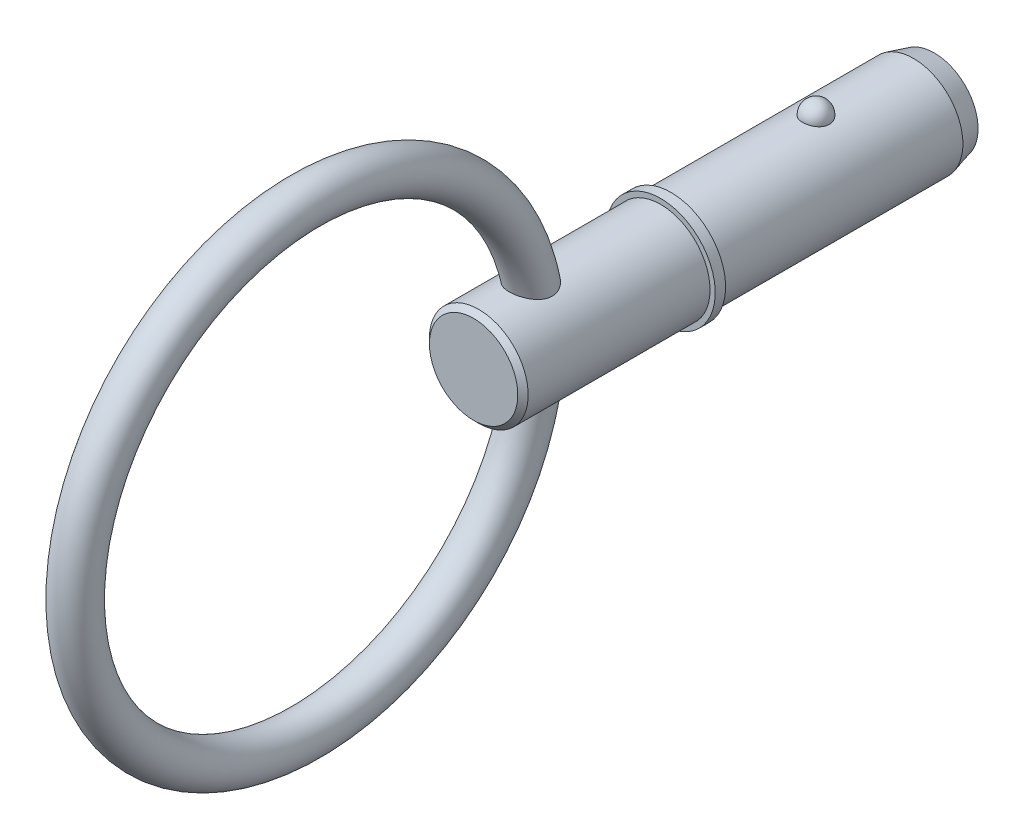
ISO-10303-21;
HEADER;
FILE_DESCRIPTION(('STEP AP214'),'2;1');
FILE_NAME('part.step','',(''),(''),'','','');
FILE_SCHEMA(('AUTOMOTIVE_DESIGN { 1 0 10303 214 1 1 1 1 }'));
ENDSEC;
DATA;
#1=APPLICATION_CONTEXT('core data for automotive mechanical design processes');
#2=APPLICATION_PROTOCOL_DEFINITION('international standard','automotive_design',2000,#1);
#3=PRODUCT_CONTEXT('',#1,'mechanical');
#4=PRODUCT('Part','Part','',(#3));
#5=PRODUCT_RELATED_PRODUCT_CATEGORY('part','',(#4));
#6=PRODUCT_DEFINITION_FORMATION('','',#4);
#7=PRODUCT_DEFINITION_CONTEXT('part definition',#1,'design');
#8=PRODUCT_DEFINITION('design','',#6,#7);
#9=PRODUCT_DEFINITION_SHAPE('','',#8);
#10=(LENGTH_UNIT() NAMED_UNIT(*) SI_UNIT(.MILLI.,.METRE.));
#11=(NAMED_UNIT(*) PLANE_ANGLE_UNIT() SI_UNIT($,.RADIAN.));
#12=(NAMED_UNIT(*) SI_UNIT($,.STERADIAN.) SOLID_ANGLE_UNIT());
#13=UNCERTAINTY_MEASURE_WITH_UNIT(LENGTH_MEASURE(1.E-05),#10,'distance_accuracy_value','');
#14=(GEOMETRIC_REPRESENTATION_CONTEXT(3) GLOBAL_UNCERTAINTY_ASSIGNED_CONTEXT((#13)) GLOBAL_UNIT_ASSIGNED_CONTEXT((#10,
#11,#12)) REPRESENTATION_CONTEXT('',''));
#15=CARTESIAN_POINT('',(0.,0.,0.));
#16=DIRECTION('',(0.,0.,1.));
#17=DIRECTION('',(1.,0.,0.));
#18=AXIS2_PLACEMENT_3D('',#15,#16,#17);
#19=CARTESIAN_POINT('',(0.,0.,12.7));
#20=DIRECTION('',(0.,0.,-1.));
#21=DIRECTION('',(-1.,0.,0.));
#22=AXIS2_PLACEMENT_3D('',#19,#20,#21);
#23=CYLINDRICAL_SURFACE('',#22,4.765);
#24=CARTESIAN_POINT('',(1.27812710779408,4.59038300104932,-1.28999999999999));
#25=CARTESIAN_POINT('',(1.27812572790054,4.59038414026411,-1.21786886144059));
#26=CARTESIAN_POINT('',(1.27223018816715,4.59203736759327,-1.14572000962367));
#27=CARTESIAN_POINT('',(1.24878929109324,4.59846646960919,-1.00346315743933));
#28=CARTESIAN_POINT('',(1.23123896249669,4.60324367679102,-0.933356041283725));
#29=CARTESIAN_POINT('',(1.18493861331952,4.61537801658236,-0.797215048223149));
#30=CARTESIAN_POINT('',(1.15619354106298,4.62273400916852,-0.731179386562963));
#31=CARTESIAN_POINT('',(1.08822596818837,4.6392032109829,-0.604986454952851));
#32=CARTESIAN_POINT('',(1.04900384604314,4.64831635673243,-0.544828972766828));
#33=CARTESIAN_POINT('',(0.960865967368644,4.66733302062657,-0.431775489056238));
#34=CARTESIAN_POINT('',(0.911906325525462,4.67723999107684,-0.378914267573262));
#35=CARTESIAN_POINT('',(0.805678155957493,4.69670280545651,-0.282245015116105));
#36=CARTESIAN_POINT('',(0.748409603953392,4.70625864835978,-0.238437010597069));
#37=CARTESIAN_POINT('',(0.627266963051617,4.72392767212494,-0.161207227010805));
#38=CARTESIAN_POINT('',(0.563411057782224,4.73204466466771,-0.127757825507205));
#39=CARTESIAN_POINT('',(0.430755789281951,4.74595788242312,-0.0720471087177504));
#40=CARTESIAN_POINT('',(0.361956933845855,4.75175434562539,-0.0497846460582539));
#41=CARTESIAN_POINT('',(0.222605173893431,4.76030056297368,-0.017375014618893));
#42=CARTESIAN_POINT('',(0.152101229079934,4.76309991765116,-0.00703038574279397));
#43=CARTESIAN_POINT('',(0.0103009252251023,4.76551622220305,0.00191361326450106));
#44=CARTESIAN_POINT('',(-0.0609953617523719,4.76513345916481,0.000514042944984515));
#45=CARTESIAN_POINT('',(-0.201348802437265,4.76125496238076,-0.0138891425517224));
#46=CARTESIAN_POINT('',(-0.270423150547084,4.75780093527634,-0.0267372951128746));
#47=CARTESIAN_POINT('',(-0.405377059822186,4.74820737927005,-0.0634598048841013));
#48=CARTESIAN_POINT('',(-0.4712565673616,4.74206780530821,-0.0873343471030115));
#49=CARTESIAN_POINT('',(-0.598375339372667,4.72771507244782,-0.145611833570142));
#50=CARTESIAN_POINT('',(-0.659587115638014,4.71949070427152,-0.180071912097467));
#51=CARTESIAN_POINT('',(-0.775356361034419,4.70185936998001,-0.258542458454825));
#52=CARTESIAN_POINT('',(-0.829913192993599,4.69245229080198,-0.302553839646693));
#53=CARTESIAN_POINT('',(-0.931895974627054,4.67327936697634,-0.399829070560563));
#54=CARTESIAN_POINT('',(-0.979176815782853,4.66351011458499,-0.453244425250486));
#55=CARTESIAN_POINT('',(-1.06421220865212,4.64484426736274,-0.567321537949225));
#56=CARTESIAN_POINT('',(-1.10196613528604,4.63594772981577,-0.627983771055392));
#57=CARTESIAN_POINT('',(-1.16735225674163,4.61992036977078,-0.755585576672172));
#58=CARTESIAN_POINT('',(-1.19487251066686,4.61280933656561,-0.822585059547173));
#59=CARTESIAN_POINT('',(-1.23851975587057,4.60128324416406,-0.960417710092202));
#60=CARTESIAN_POINT('',(-1.25464705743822,4.59686811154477,-1.03125077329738));
#61=CARTESIAN_POINT('',(-1.27505790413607,4.59124882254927,-1.17443804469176));
#62=CARTESIAN_POINT('',(-1.27938868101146,4.59003186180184,-1.246785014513));
#63=CARTESIAN_POINT('',(-1.27623192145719,4.5909105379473,-1.39119892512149));
#64=CARTESIAN_POINT('',(-1.26874468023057,4.59300609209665,-1.46326587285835));
#65=CARTESIAN_POINT('',(-1.24220427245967,4.60025423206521,-1.60473192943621));
#66=CARTESIAN_POINT('',(-1.2232043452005,4.60539274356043,-1.67414176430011));
#67=CARTESIAN_POINT('',(-1.17415910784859,4.61813957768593,-1.80870154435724));
#68=CARTESIAN_POINT('',(-1.1441133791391,4.62574799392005,-1.87385132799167));
#69=CARTESIAN_POINT('',(-1.07354327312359,4.64263368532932,-1.99841604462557));
#70=CARTESIAN_POINT('',(-1.03296580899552,4.65191934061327,-2.05779976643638));
#71=CARTESIAN_POINT('',(-0.942433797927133,4.67110036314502,-2.16881966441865));
#72=CARTESIAN_POINT('',(-0.892478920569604,4.68099575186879,-2.22045556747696));
#73=CARTESIAN_POINT('',(-0.78430278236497,4.70033161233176,-2.31471696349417));
#74=CARTESIAN_POINT('',(-0.726054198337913,4.70977043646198,-2.35731146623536));
#75=CARTESIAN_POINT('',(-0.602997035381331,4.72709995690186,-2.43206620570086));
#76=CARTESIAN_POINT('',(-0.538188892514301,4.73499075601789,-2.46422713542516));
#77=CARTESIAN_POINT('',(-0.404639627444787,4.7482563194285,-2.5168745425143));
#78=CARTESIAN_POINT('',(-0.335953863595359,4.7536596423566,-2.53749415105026));
#79=CARTESIAN_POINT('',(-0.195948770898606,4.76148510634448,-2.5670372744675));
#80=CARTESIAN_POINT('',(-0.124629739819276,4.76390758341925,-2.5759621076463));
#81=CARTESIAN_POINT('',(0.0172696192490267,4.76548774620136,-2.5818033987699));
#82=CARTESIAN_POINT('',(0.0878407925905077,4.76470225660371,-2.57892886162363));
#83=CARTESIAN_POINT('',(0.227467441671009,4.76008019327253,-2.561726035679));
#84=CARTESIAN_POINT('',(0.296522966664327,4.75624371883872,-2.5473981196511));
#85=CARTESIAN_POINT('',(0.430942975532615,4.74595041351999,-2.50776251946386));
#86=CARTESIAN_POINT('',(0.496319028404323,4.7395023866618,-2.4824917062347));
#87=CARTESIAN_POINT('',(0.621860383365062,4.72467083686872,-2.42167301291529));
#88=CARTESIAN_POINT('',(0.682025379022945,4.71628720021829,-2.38612452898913));
#89=CARTESIAN_POINT('',(0.796409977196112,4.69833598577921,-2.30511163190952));
#90=CARTESIAN_POINT('',(0.850529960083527,4.68875291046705,-2.25951003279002));
#91=CARTESIAN_POINT('',(0.950412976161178,4.66953243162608,-2.15992428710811));
#92=CARTESIAN_POINT('',(0.996174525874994,4.65989501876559,-2.1059386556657));
#93=CARTESIAN_POINT('',(1.07885962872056,4.64145616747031,-1.99009376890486));
#94=CARTESIAN_POINT('',(1.11562789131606,4.63267081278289,-1.92812106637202));
#95=CARTESIAN_POINT('',(1.17840570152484,4.61710269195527,-1.79873681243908));
#96=CARTESIAN_POINT('',(1.20441973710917,4.61031909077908,-1.73132754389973));
#97=CARTESIAN_POINT('',(1.24242116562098,4.60021170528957,-1.60192906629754));
#98=CARTESIAN_POINT('',(1.25578772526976,4.59655387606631,-1.54036674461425));
#99=CARTESIAN_POINT('',(1.27364121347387,4.59163904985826,-1.41587409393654));
#100=CARTESIAN_POINT('',(1.2781283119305,4.59038200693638,-1.35294379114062));
#101=CARTESIAN_POINT('',(1.27812710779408,4.59038300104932,-1.28999999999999));
#102=B_SPLINE_CURVE_WITH_KNOTS('',3,(#24,#25,#26,#27,#28,#29,#30,#31,#32,#33,#34,#35,#36,#37,
#38,#39,#40,#41,#42,#43,#44,#45,#46,#47,#48,#49,#50,#51,#52,#53,#54,#55,#56,#57,#58,#59,#60,#61,
#62,#63,#64,#65,#66,#67,#68,#69,#70,#71,#72,#73,#74,#75,#76,#77,#78,#79,#80,#81,#82,#83,#84,#85,
#86,#87,#88,#89,#90,#91,#92,#93,#94,#95,#96,#97,#98,#99,#100,#101),.UNSPECIFIED.,.T.,.F.,(4,2,2,
2,2,2,2,2,2,2,2,2,2,2,2,2,2,2,2,2,2,2,2,2,2,2,2,2,2,2,2,2,2,2,2,2,2,2,4),(0.,0.216167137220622,
0.432426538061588,0.648590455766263,0.864746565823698,1.0818998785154,1.29905382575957,
1.51562361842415,1.73217119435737,1.94507683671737,2.15796327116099,2.36800220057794,
2.57804465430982,2.78924132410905,3.00045819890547,3.21545551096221,3.43046692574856,
3.64776550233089,3.8650581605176,4.08147951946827,4.29789547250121,4.51331818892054,
4.72874907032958,4.94528769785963,5.16183395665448,5.37911087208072,5.59637335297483,
5.81107510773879,6.02575265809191,6.23664413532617,6.44752874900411,6.65770827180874,
6.86790014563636,7.08116060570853,7.29445887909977,7.51121476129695,7.72788009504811,
7.91651762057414,8.10515153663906),.UNSPECIFIED.);
#103=CARTESIAN_POINT('',(1.27812710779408,4.59038300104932,-1.28999999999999));
#104=VERTEX_POINT('',#103);
#105=EDGE_CURVE('E102',#104,#104,#102,.T.);
#106=ORIENTED_EDGE('',*,*,#105,.T.);
#107=EDGE_LOOP('',(#106));
#108=FACE_BOUND('',#107,.T.);
#109=CARTESIAN_POINT('',(0.,0.,-10.7));
#110=DIRECTION('',(0.,0.,-1.));
#111=DIRECTION('',(-1.,0.,0.));
#112=AXIS2_PLACEMENT_3D('',#109,#110,#111);
#113=CIRCLE('',#112,4.765);
#114=CARTESIAN_POINT('',(-4.765,0.,-10.7));
#115=VERTEX_POINT('',#114);
#116=EDGE_CURVE('E109',#115,#115,#113,.F.);
#117=ORIENTED_EDGE('',*,*,#116,.T.);
#118=EDGE_LOOP('',(#117));
#119=FACE_BOUND('',#118,.T.);
#120=CARTESIAN_POINT('',(0.,0.,12.7));
#121=DIRECTION('',(0.,0.,1.));
#122=DIRECTION('',(1.,0.,0.));
#123=AXIS2_PLACEMENT_3D('',#120,#121,#122);
#124=CIRCLE('',#123,4.765);
#125=CARTESIAN_POINT('',(4.765,0.,12.7));
#126=VERTEX_POINT('',#125);
#127=EDGE_CURVE('E107',#126,#126,#124,.T.);
#128=ORIENTED_EDGE('',*,*,#127,.F.);
#129=EDGE_LOOP('',(#128));
#130=FACE_BOUND('',#129,.T.);
#131=ADVANCED_FACE('F39',(#108,#119,#130),#23,.T.);
#132=CARTESIAN_POINT('',(0.,0.,-12.7));
#133=DIRECTION('',(0.,0.,-1.));
#134=DIRECTION('',(-1.,0.,0.));
#135=AXIS2_PLACEMENT_3D('',#132,#133,#134);
#136=PLANE('',#135);
#137=CARTESIAN_POINT('',(0.,0.,-12.7));
#138=DIRECTION('',(0.,0.,-1.));
#139=DIRECTION('',(-1.,0.,0.));
#140=AXIS2_PLACEMENT_3D('',#137,#138,#139);
#141=CIRCLE('',#140,4.22910161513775);
#142=CARTESIAN_POINT('',(-4.22910161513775,0.,-12.7));
#143=VERTEX_POINT('',#142);
#144=EDGE_CURVE('E142',#143,#143,#141,.T.);
#145=ORIENTED_EDGE('',*,*,#144,.T.);
#146=EDGE_LOOP('',(#145));
#147=FACE_BOUND('',#146,.T.);
#148=ADVANCED_FACE('F88',(#147),#136,.T.);
#149=CARTESIAN_POINT('',(0.,0.,-12.7));
#150=DIRECTION('',(0.,0.,1.));
#151=DIRECTION('',(1.,0.,0.));
#152=AXIS2_PLACEMENT_3D('',#149,#150,#151);
#153=CONICAL_SURFACE('',#152,4.22910161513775,0.261799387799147);
#154=ORIENTED_EDGE('',*,*,#116,.F.);
#155=EDGE_LOOP('',(#154));
#156=FACE_BOUND('',#155,.T.);
#157=ORIENTED_EDGE('',*,*,#144,.F.);
#158=EDGE_LOOP('',(#157));
#159=FACE_BOUND('',#158,.T.);
#160=ADVANCED_FACE('F94',(#156,#159),#153,.T.);
#161=CARTESIAN_POINT('',(0.,4.765,-1.28999999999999));
#162=DIRECTION('',(0.,1.,0.));
#163=DIRECTION('',(0.,0.,-1.));
#164=AXIS2_PLACEMENT_3D('',#161,#162,#163);
#165=SPHERICAL_SURFACE('',#164,1.29);
#166=ORIENTED_EDGE('',*,*,#105,.F.);
#167=EDGE_LOOP('',(#166));
#168=FACE_BOUND('',#167,.T.);
#169=ADVANCED_FACE('F112',(#168),#165,.T.);
#170=CARTESIAN_POINT('',(0.,0.,12.7));
#171=DIRECTION('',(0.,0.,-1.));
#172=DIRECTION('',(-1.,0.,0.));
#173=AXIS2_PLACEMENT_3D('',#170,#171,#172);
#174=PLANE('',#173);
#175=ORIENTED_EDGE('',*,*,#127,.T.);
#176=EDGE_LOOP('',(#175));
#177=FACE_BOUND('',#176,.T.);
#178=CARTESIAN_POINT('',(0.,0.,12.7));
#179=DIRECTION('',(0.,0.,-1.));
#180=DIRECTION('',(-1.,0.,0.));
#181=AXIS2_PLACEMENT_3D('',#178,#179,#180);
#182=CIRCLE('',#181,5.265);
#183=CARTESIAN_POINT('',(-5.265,0.,12.7));
#184=VERTEX_POINT('',#183);
#185=EDGE_CURVE('E108',#184,#184,#182,.T.);
#186=ORIENTED_EDGE('',*,*,#185,.T.);
#187=EDGE_LOOP('',(#186));
#188=FACE_BOUND('',#187,.T.);
#189=ADVANCED_FACE('F116',(#177,#188),#174,.T.);
#190=CARTESIAN_POINT('',(0.,0.,33.7287874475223));
#191=DIRECTION('',(0.,0.,-1.));
#192=DIRECTION('',(-1.,0.,0.));
#193=AXIS2_PLACEMENT_3D('',#190,#191,#192);
#194=CYLINDRICAL_SURFACE('',#193,5.265);
#195=CARTESIAN_POINT('',(0.,0.,13.7));
#196=DIRECTION('',(0.,0.,-1.));
#197=DIRECTION('',(-1.,0.,0.));
#198=AXIS2_PLACEMENT_3D('',#195,#196,#197);
#199=CIRCLE('',#198,5.265);
#200=CARTESIAN_POINT('',(-5.265,0.,13.7));
#201=VERTEX_POINT('',#200);
#202=EDGE_CURVE('E133',#201,#201,#199,.T.);
#203=ORIENTED_EDGE('',*,*,#202,.T.);
#204=EDGE_LOOP('',(#203));
#205=FACE_BOUND('',#204,.T.);
#206=ORIENTED_EDGE('',*,*,#185,.F.);
#207=EDGE_LOOP('',(#206));
#208=FACE_BOUND('',#207,.T.);
#209=ADVANCED_FACE('F120',(#205,#208),#194,.T.);
#210=CARTESIAN_POINT('',(0.,5.265,13.7));
#211=DIRECTION('',(0.,0.,1.));
#212=DIRECTION('',(1.,0.,0.));
#213=AXIS2_PLACEMENT_3D('',#210,#211,#212);
#214=PLANE('',#213);
#215=CARTESIAN_POINT('',(0.,0.,13.7));
#216=DIRECTION('',(0.,0.,1.));
#217=DIRECTION('',(1.,0.,0.));
#218=AXIS2_PLACEMENT_3D('',#215,#216,#217);
#219=CIRCLE('',#218,4.765);
#220=CARTESIAN_POINT('',(4.765,0.,13.7));
#221=VERTEX_POINT('',#220);
#222=EDGE_CURVE('E111',#221,#221,#219,.T.);
#223=ORIENTED_EDGE('',*,*,#222,.F.);
#224=EDGE_LOOP('',(#223));
#225=FACE_BOUND('',#224,.T.);
#226=ORIENTED_EDGE('',*,*,#202,.F.);
#227=EDGE_LOOP('',(#226));
#228=FACE_BOUND('',#227,.T.);
#229=ADVANCED_FACE('F85',(#225,#228),#214,.T.);
#230=CARTESIAN_POINT('',(0.,0.,31.75));
#231=DIRECTION('',(0.,0.,-1.));
#232=DIRECTION('',(-1.,0.,0.));
#233=AXIS2_PLACEMENT_3D('',#230,#231,#232);
#234=CYLINDRICAL_SURFACE('',#233,4.765);
#235=CARTESIAN_POINT('',(-1.17603588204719,-4.61759294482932,24.5837200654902));
#236=CARTESIAN_POINT('',(-1.08605054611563,-4.6405075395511,24.5215688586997));
#237=CARTESIAN_POINT('',(-0.990486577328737,-4.66202408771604,24.4667393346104));
#238=CARTESIAN_POINT('',(-0.79076273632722,-4.70002969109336,24.3729957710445));
#239=CARTESIAN_POINT('',(-0.686587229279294,-4.7165093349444,24.3341114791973));
#240=CARTESIAN_POINT('',(-0.472539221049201,-4.7427361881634,24.273267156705));
#241=CARTESIAN_POINT('',(-0.362665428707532,-4.7524818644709,24.2513109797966));
#242=CARTESIAN_POINT('',(-0.140482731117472,-4.7642267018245,24.2249366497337));
#243=CARTESIAN_POINT('',(-0.028175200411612,-4.7662301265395,24.2205088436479));
#244=CARTESIAN_POINT('',(0.193745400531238,-4.76233166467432,24.2292082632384));
#245=CARTESIAN_POINT('',(0.303372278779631,-4.75656024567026,24.2420457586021));
#246=CARTESIAN_POINT('',(0.518724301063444,-4.73791484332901,24.2844340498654));
#247=CARTESIAN_POINT('',(0.624448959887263,-4.72503997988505,24.3139869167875));
#248=CARTESIAN_POINT('',(0.829434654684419,-4.69340588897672,24.3892085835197));
#249=CARTESIAN_POINT('',(0.928674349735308,-4.6746283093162,24.4349277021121));
#250=CARTESIAN_POINT('',(1.11777413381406,-4.63305392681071,24.5414733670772));
#251=CARTESIAN_POINT('',(1.20763216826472,-4.61025624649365,24.6023032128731));
#252=CARTESIAN_POINT('',(1.37762760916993,-4.56238439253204,24.7394393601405));
#253=CARTESIAN_POINT('',(1.45749020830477,-4.53726959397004,24.8160728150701));
#254=CARTESIAN_POINT('',(1.60275140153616,-4.48801828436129,24.9822939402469));
#255=CARTESIAN_POINT('',(1.66815155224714,-4.46388166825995,25.071880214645));
#256=CARTESIAN_POINT('',(1.78162069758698,-4.41980966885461,25.2604689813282));
#257=CARTESIAN_POINT('',(1.82993675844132,-4.3998162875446,25.3593086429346));
#258=CARTESIAN_POINT('',(1.90902953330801,-4.36608532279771,25.5647395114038));
#259=CARTESIAN_POINT('',(1.93981696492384,-4.35234391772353,25.6713259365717));
#260=CARTESIAN_POINT('',(1.9818112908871,-4.33337618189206,25.882380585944));
#261=CARTESIAN_POINT('',(1.99406945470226,-4.32769391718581,25.98660066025));
#262=CARTESIAN_POINT('',(2.0025484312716,-4.32377679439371,26.1958125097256));
#263=CARTESIAN_POINT('',(1.99876733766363,-4.32554282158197,26.3008043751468));
#264=CARTESIAN_POINT('',(1.97595504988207,-4.33600911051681,26.5091056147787));
#265=CARTESIAN_POINT('',(1.95686739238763,-4.3447350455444,26.6124073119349));
#266=CARTESIAN_POINT('',(1.90457346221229,-4.36790947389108,26.8146792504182));
#267=CARTESIAN_POINT('',(1.87136191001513,-4.38236010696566,26.9136478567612));
#268=CARTESIAN_POINT('',(1.78747856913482,-4.41728816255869,27.1164706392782));
#269=CARTESIAN_POINT('',(1.73524632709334,-4.43826528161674,27.2195927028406));
#270=CARTESIAN_POINT('',(1.61607256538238,-4.48303292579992,27.4163865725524));
#271=CARTESIAN_POINT('',(1.5491157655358,-4.50682636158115,27.5100484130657));
#272=CARTESIAN_POINT('',(1.39359064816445,-4.55746895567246,27.6953838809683));
#273=CARTESIAN_POINT('',(1.30346928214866,-4.58437060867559,27.7857503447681));
#274=CARTESIAN_POINT('',(1.1079439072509,-4.6354985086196,27.9490111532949));
#275=CARTESIAN_POINT('',(1.00255934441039,-4.65972809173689,28.0219274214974));
#276=CARTESIAN_POINT('',(0.803761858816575,-4.69755503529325,28.1324077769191));
#277=CARTESIAN_POINT('',(0.71293567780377,-4.71231838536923,28.1742306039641));
#278=CARTESIAN_POINT('',(0.525172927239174,-4.73691370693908,28.2429362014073));
#279=CARTESIAN_POINT('',(0.428242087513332,-4.7467502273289,28.2698327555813));
#280=CARTESIAN_POINT('',(0.230351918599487,-4.76046566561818,28.3071470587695));
#281=CARTESIAN_POINT('',(0.129376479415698,-4.76431768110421,28.3174904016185));
#282=CARTESIAN_POINT('',(-0.0728965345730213,-4.76551495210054,28.3207168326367));
#283=CARTESIAN_POINT('',(-0.174194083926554,-4.76286070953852,28.3136012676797));
#284=CARTESIAN_POINT('',(-0.366467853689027,-4.751792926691,28.2835798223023));
#285=CARTESIAN_POINT('',(-0.457659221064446,-4.74381187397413,28.2618588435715));
#286=CARTESIAN_POINT('',(-0.635226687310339,-4.72331548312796,28.2050844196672));
#287=CARTESIAN_POINT('',(-0.721601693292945,-4.71079912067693,28.1700279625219));
#288=CARTESIAN_POINT('',(-0.893212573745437,-4.68139468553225,28.0855597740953));
#289=CARTESIAN_POINT('',(-0.978027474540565,-4.66427939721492,28.0353775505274));
#290=CARTESIAN_POINT('',(-1.13917803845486,-4.62756330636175,27.9236420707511));
#291=CARTESIAN_POINT('',(-1.21550961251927,-4.60796131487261,27.8620833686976));
#292=CARTESIAN_POINT('',(-1.37033540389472,-4.56452178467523,27.7186885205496));
#293=CARTESIAN_POINT('',(-1.44723650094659,-4.5405070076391,27.6351843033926));
#294=CARTESIAN_POINT('',(-1.587638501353,-4.49334232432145,27.4572920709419));
#295=CARTESIAN_POINT('',(-1.65112672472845,-4.47019325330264,27.3628938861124));
#296=CARTESIAN_POINT('',(-1.77033243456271,-4.42444393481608,27.1532060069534));
#297=CARTESIAN_POINT('',(-1.82420433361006,-4.40224259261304,27.0367685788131));
#298=CARTESIAN_POINT('',(-1.91169086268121,-4.36496831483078,26.7954090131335));
#299=CARTESIAN_POINT('',(-1.94531523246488,-4.34989195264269,26.6704909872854));
#300=CARTESIAN_POINT('',(-1.98892523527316,-4.33012255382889,26.4220163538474));
#301=CARTESIAN_POINT('',(-1.99998275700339,-4.32495941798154,26.2986899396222));
#302=CARTESIAN_POINT('',(-2.00001713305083,-4.32494814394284,26.0520738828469));
#303=CARTESIAN_POINT('',(-1.98902141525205,-4.33008719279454,25.9287843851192));
#304=CARTESIAN_POINT('',(-1.94752572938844,-4.34888267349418,25.7032137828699));
#305=CARTESIAN_POINT('',(-1.91979754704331,-4.36132278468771,25.6003106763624));
#306=CARTESIAN_POINT('',(-1.84805595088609,-4.39220107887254,25.4012512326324));
#307=CARTESIAN_POINT('',(-1.80403476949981,-4.4106421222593,25.3050981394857));
#308=CARTESIAN_POINT('',(-1.70232000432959,-4.4508689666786,25.1244579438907));
#309=CARTESIAN_POINT('',(-1.64499853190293,-4.47255887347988,25.0397380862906));
#310=CARTESIAN_POINT('',(-1.51770958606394,-4.51733419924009,24.8810122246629));
#311=CARTESIAN_POINT('',(-1.44776268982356,-4.54041730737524,24.8069891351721));
#312=CARTESIAN_POINT('',(-1.34143544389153,-4.57239833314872,24.71104340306));
#313=CARTESIAN_POINT('',(-1.30955259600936,-4.58164274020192,24.6841153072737));
#314=CARTESIAN_POINT('',(-1.24406394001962,-4.59985727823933,24.6323409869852));
#315=CARTESIAN_POINT('',(-1.21045807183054,-4.6088273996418,24.6074948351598));
#316=CARTESIAN_POINT('',(-1.17603588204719,-4.61759294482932,24.5837200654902));
#317=B_SPLINE_CURVE_WITH_KNOTS('',3,(#235,#236,#237,#238,#239,#240,#241,#242,#243,#244,#245,
#246,#247,#248,#249,#250,#251,#252,#253,#254,#255,#256,#257,#258,#259,#260,#261,#262,#263,#264,
#265,#266,#267,#268,#269,#270,#271,#272,#273,#274,#275,#276,#277,#278,#279,#280,#281,#282,#283,
#284,#285,#286,#287,#288,#289,#290,#291,#292,#293,#294,#295,#296,#297,#298,#299,#300,#301,#302,
#303,#304,#305,#306,#307,#308,#309,#310,#311,#312,#313,#314,#315,#316),.UNSPECIFIED.,.T.,.F.,(4,
2,2,2,2,2,2,2,2,2,2,2,2,2,2,2,2,2,2,2,2,2,2,2,2,2,2,2,2,2,2,2,2,2,2,2,2,2,2,2,4),(0.,
0.335054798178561,0.67073186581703,1.00648532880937,1.34205386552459,1.67206089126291,
2.00210881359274,2.33319321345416,2.66434996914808,3.00321157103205,3.34203668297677,
3.67573940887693,4.00923787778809,4.32299322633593,4.63678586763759,4.95174139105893,
5.26681474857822,5.6178575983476,5.96926647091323,6.35862694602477,6.74749565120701,
7.04947204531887,7.35116911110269,7.65421852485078,7.95724456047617,8.23825252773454,
8.51932400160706,8.81825171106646,9.11732288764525,9.46404422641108,9.81109188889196,
10.1997682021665,10.5882573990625,10.9578189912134,11.32692124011,11.6472091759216,
11.9676500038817,12.2800235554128,12.5918925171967,12.7200569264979,12.8482258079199),.UNSPECIFIED.);
#318=CARTESIAN_POINT('',(-1.17603588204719,-4.61759294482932,24.5837200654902));
#319=VERTEX_POINT('',#318);
#320=EDGE_CURVE('E10',#319,#319,#317,.T.);
#321=ORIENTED_EDGE('',*,*,#320,.F.);
#322=EDGE_LOOP('',(#321));
#323=FACE_BOUND('',#322,.T.);
#324=CARTESIAN_POINT('',(-1.17603588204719,4.61759294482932,24.5837200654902));
#325=CARTESIAN_POINT('',(-1.26499234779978,4.59493450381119,24.6451699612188));
#326=CARTESIAN_POINT('',(-1.34870034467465,4.57085993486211,24.7139152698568));
#327=CARTESIAN_POINT('',(-1.50334626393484,4.52236448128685,24.864635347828));
#328=CARTESIAN_POINT('',(-1.57425996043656,4.49794303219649,24.9466346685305));
#329=CARTESIAN_POINT('',(-1.7013018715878,4.45144771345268,25.1222345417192));
#330=CARTESIAN_POINT('',(-1.75740699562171,4.42937754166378,25.2158528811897));
#331=CARTESIAN_POINT('',(-1.85287755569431,4.39030189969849,25.4121668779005));
#332=CARTESIAN_POINT('',(-1.89225871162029,4.37329167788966,25.5148539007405));
#333=CARTESIAN_POINT('',(-1.95188661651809,4.34699775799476,25.7218576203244));
#334=CARTESIAN_POINT('',(-1.97286468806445,4.33742068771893,25.8259265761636));
#335=CARTESIAN_POINT('',(-1.99814509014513,4.32583397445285,26.0364714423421));
#336=CARTESIAN_POINT('',(-2.00244696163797,4.32382453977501,26.1429474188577));
#337=CARTESIAN_POINT('',(-1.99499900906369,4.32726361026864,26.3527706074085));
#338=CARTESIAN_POINT('',(-1.9836061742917,4.33254625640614,26.456134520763));
#339=CARTESIAN_POINT('',(-1.94643618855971,4.34936983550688,26.6596911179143));
#340=CARTESIAN_POINT('',(-1.92065444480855,4.3609127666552,26.7598827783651));
#341=CARTESIAN_POINT('',(-1.85292379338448,4.3901452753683,26.9641042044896));
#342=CARTESIAN_POINT('',(-1.80971134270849,4.40830066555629,27.0676462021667));
#343=CARTESIAN_POINT('',(-1.70892742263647,4.44833985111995,27.2667684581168));
#344=CARTESIAN_POINT('',(-1.65134284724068,4.47022704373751,27.3623413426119));
#345=CARTESIAN_POINT('',(-1.51475300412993,4.51847764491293,27.5552600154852));
#346=CARTESIAN_POINT('',(-1.43395667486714,4.54505660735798,27.6512914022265));
#347=CARTESIAN_POINT('',(-1.25684082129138,4.59718102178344,27.8281328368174));
#348=CARTESIAN_POINT('',(-1.1605312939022,4.62272712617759,27.9089526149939));
#349=CARTESIAN_POINT('',(-0.972192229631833,4.66558476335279,28.0393265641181));
#350=CARTESIAN_POINT('',(-0.882391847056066,4.68355428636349,28.0918799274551));
#351=CARTESIAN_POINT('',(-0.69483616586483,4.71502283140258,28.1820221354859));
#352=CARTESIAN_POINT('',(-0.597087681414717,4.72852563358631,28.2196236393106));
#353=CARTESIAN_POINT('',(-0.395321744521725,4.74966109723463,28.2778751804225));
#354=CARTESIAN_POINT('',(-0.291269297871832,4.7572569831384,28.2984190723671));
#355=CARTESIAN_POINT('',(-0.0808979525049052,4.76547327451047,28.3206246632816));
#356=CARTESIAN_POINT('',(0.0254198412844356,4.76609700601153,28.3222953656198));
#357=CARTESIAN_POINT('',(0.225327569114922,4.7606097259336,28.3074850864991));
#358=CARTESIAN_POINT('',(0.319084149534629,4.75519734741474,28.2928871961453));
#359=CARTESIAN_POINT('',(0.502750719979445,4.73930039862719,28.2493972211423));
#360=CARTESIAN_POINT('',(0.592660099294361,4.7288150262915,28.220502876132));
#361=CARTESIAN_POINT('',(0.768777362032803,4.70343779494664,28.1490413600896));
#362=CARTESIAN_POINT('',(0.854839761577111,4.68844387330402,28.1061552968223));
#363=CARTESIAN_POINT('',(1.01943666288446,4.65543047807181,28.0087469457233));
#364=CARTESIAN_POINT('',(1.09796821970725,4.63740982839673,27.9542201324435));
#365=CARTESIAN_POINT('',(1.25751825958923,4.59691257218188,27.8264656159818));
#366=CARTESIAN_POINT('',(1.33721103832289,4.57417011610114,27.7516678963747));
#367=CARTESIAN_POINT('',(1.48461190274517,4.52847869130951,27.5910829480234));
#368=CARTESIAN_POINT('',(1.55230949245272,4.50552956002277,27.5052862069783));
#369=CARTESIAN_POINT('',(1.68366050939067,4.45825797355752,27.3114045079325));
#370=CARTESIAN_POINT('',(1.74532014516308,4.43421533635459,27.2018899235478));
#371=CARTESIAN_POINT('',(1.85007805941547,4.39154308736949,26.9732696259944));
#372=CARTESIAN_POINT('',(1.89317429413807,4.37291407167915,26.8541628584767));
#373=CARTESIAN_POINT('',(1.958572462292,4.34402041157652,26.6097631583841));
#374=CARTESIAN_POINT('',(1.98095022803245,4.33372528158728,26.484494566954));
#375=CARTESIAN_POINT('',(2.00301292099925,4.32358016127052,26.2315942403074));
#376=CARTESIAN_POINT('',(2.00273000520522,4.32371536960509,26.1039661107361));
#377=CARTESIAN_POINT('',(1.97997568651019,4.3341693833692,25.8682474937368));
#378=CARTESIAN_POINT('',(1.96044562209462,4.34313814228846,25.7598066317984));
#379=CARTESIAN_POINT('',(1.903681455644,4.3683153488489,25.5485431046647));
#380=CARTESIAN_POINT('',(1.86644884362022,4.38452318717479,25.4457199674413));
#381=CARTESIAN_POINT('',(1.7781154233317,4.42104679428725,25.2547100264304));
#382=CARTESIAN_POINT('',(1.72797707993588,4.44105894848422,25.1660156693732));
#383=CARTESIAN_POINT('',(1.61439500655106,4.48359504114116,24.9982868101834));
#384=CARTESIAN_POINT('',(1.55094927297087,4.50611935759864,24.9192537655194));
#385=CARTESIAN_POINT('',(1.40889349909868,4.55259151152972,24.7687053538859));
#386=CARTESIAN_POINT('',(1.32968750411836,4.57655455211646,24.6977571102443));
#387=CARTESIAN_POINT('',(1.16035884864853,4.62238936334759,24.5695060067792));
#388=CARTESIAN_POINT('',(1.07023361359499,4.64426063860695,24.5122063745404));
#389=CARTESIAN_POINT('',(0.87736289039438,4.68460759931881,24.4103166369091));
#390=CARTESIAN_POINT('',(0.774249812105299,4.70290564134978,24.3663495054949));
#391=CARTESIAN_POINT('',(0.561430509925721,4.73302876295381,24.2954843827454));
#392=CARTESIAN_POINT('',(0.451725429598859,4.74485496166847,24.2685834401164));
#393=CARTESIAN_POINT('',(0.230282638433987,4.76071009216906,24.2327633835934));
#394=CARTESIAN_POINT('',(0.118587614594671,4.76483485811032,24.2236232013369));
#395=CARTESIAN_POINT('',(-0.104911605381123,4.76515532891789,24.2229082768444));
#396=CARTESIAN_POINT('',(-0.216715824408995,4.76134861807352,24.2313388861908));
#397=CARTESIAN_POINT('',(-0.435231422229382,4.74632552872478,24.2652456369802));
#398=CARTESIAN_POINT('',(-0.54199678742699,4.73523460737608,24.2904332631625));
#399=CARTESIAN_POINT('',(-0.749371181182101,4.70686626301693,24.3569215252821));
#400=CARTESIAN_POINT('',(-0.849990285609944,4.68959930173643,24.3981949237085));
#401=CARTESIAN_POINT('',(-0.986108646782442,4.6620261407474,24.4672359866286));
#402=CARTESIAN_POINT('',(-1.02525769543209,4.65355983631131,24.4887724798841));
#403=CARTESIAN_POINT('',(-1.10191286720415,4.63600664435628,24.5343673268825));
#404=CARTESIAN_POINT('',(-1.13941901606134,4.62691976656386,24.558425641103));
#405=CARTESIAN_POINT('',(-1.17603588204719,4.61759294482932,24.5837200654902));
#406=B_SPLINE_CURVE_WITH_KNOTS('',3,(#324,#325,#326,#327,#328,#329,#330,#331,#332,#333,#334,
#335,#336,#337,#338,#339,#340,#341,#342,#343,#344,#345,#346,#347,#348,#349,#350,#351,#352,#353,
#354,#355,#356,#357,#358,#359,#360,#361,#362,#363,#364,#365,#366,#367,#368,#369,#370,#371,#372,
#373,#374,#375,#376,#377,#378,#379,#380,#381,#382,#383,#384,#385,#386,#387,#388,#389,#390,#391,
#392,#393,#394,#395,#396,#397,#398,#399,#400,#401,#402,#403,#404,#405),.UNSPECIFIED.,.T.,.F.,(4,
2,2,2,2,2,2,2,2,2,2,2,2,2,2,2,2,2,2,2,2,2,2,2,2,2,2,2,2,2,2,2,2,2,2,2,2,2,2,2,4),(0.,
0.331234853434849,0.66309046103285,0.995460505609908,1.3275174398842,1.64568783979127,
1.96386699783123,2.27492717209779,2.5860866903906,2.92571998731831,3.26566413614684,
3.64875195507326,4.0315938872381,4.34706664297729,4.66227172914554,4.97942386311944,
5.29642469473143,5.58021908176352,5.86405835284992,6.15488068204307,6.44581627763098,
6.77943874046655,7.11335170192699,7.49545660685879,7.87760356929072,8.25834622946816,
8.63854860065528,8.96843568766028,9.29829501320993,9.60842872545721,9.91860916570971,
10.2441707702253,10.5698092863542,10.9089029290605,11.2479379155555,11.5827251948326,
11.9176144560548,12.2468820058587,12.5755944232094,12.7119417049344,12.8482868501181),.UNSPECIFIED.);
#407=CARTESIAN_POINT('',(-1.17603588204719,4.61759294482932,24.5837200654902));
#408=VERTEX_POINT('',#407);
#409=EDGE_CURVE('E51',#408,#408,#406,.T.);
#410=ORIENTED_EDGE('',*,*,#409,.F.);
#411=EDGE_LOOP('',(#410));
#412=FACE_BOUND('',#411,.T.);
#413=CARTESIAN_POINT('',(0.,0.,31.25));
#414=DIRECTION('',(0.,0.,-1.));
#415=DIRECTION('',(-1.,0.,0.));
#416=AXIS2_PLACEMENT_3D('',#413,#414,#415);
#417=CIRCLE('',#416,4.765);
#418=CARTESIAN_POINT('',(-4.765,0.,31.25));
#419=VERTEX_POINT('',#418);
#420=EDGE_CURVE('E64',#419,#419,#417,.T.);
#421=ORIENTED_EDGE('',*,*,#420,.T.);
#422=EDGE_LOOP('',(#421));
#423=FACE_BOUND('',#422,.T.);
#424=ORIENTED_EDGE('',*,*,#222,.T.);
#425=EDGE_LOOP('',(#424));
#426=FACE_BOUND('',#425,.T.);
#427=ADVANCED_FACE('F69',(#323,#412,#423,#426),#234,.T.);
#428=CARTESIAN_POINT('',(0.,0.,31.75));
#429=DIRECTION('',(0.,0.,-1.));
#430=DIRECTION('',(-1.,0.,0.));
#431=AXIS2_PLACEMENT_3D('',#428,#429,#430);
#432=PLANE('',#431);
#433=CARTESIAN_POINT('',(0.,0.,31.75));
#434=DIRECTION('',(0.,0.,-1.));
#435=DIRECTION('',(-1.,0.,0.));
#436=AXIS2_PLACEMENT_3D('',#433,#434,#435);
#437=CIRCLE('',#436,4.26499999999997);
#438=CARTESIAN_POINT('',(-4.26499999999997,0.,31.75));
#439=VERTEX_POINT('',#438);
#440=EDGE_CURVE('E58',#439,#439,#437,.F.);
#441=ORIENTED_EDGE('',*,*,#440,.T.);
#442=EDGE_LOOP('',(#441));
#443=FACE_BOUND('',#442,.T.);
#444=ADVANCED_FACE('F76',(#443),#432,.F.);
#445=CARTESIAN_POINT('',(0.,0.,31.25));
#446=DIRECTION('',(0.,0.,-1.));
#447=DIRECTION('',(-1.,0.,0.));
#448=AXIS2_PLACEMENT_3D('',#445,#446,#447);
#449=CONICAL_SURFACE('',#448,4.765,0.78539816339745);
#450=ORIENTED_EDGE('',*,*,#440,.F.);
#451=EDGE_LOOP('',(#450));
#452=FACE_BOUND('',#451,.T.);
#453=ORIENTED_EDGE('',*,*,#420,.F.);
#454=EDGE_LOOP('',(#453));
#455=FACE_BOUND('',#454,.T.);
#456=ADVANCED_FACE('F41',(#452,#455),#449,.T.);
#457=CARTESIAN_POINT('',(0.,0.,47.975));
#458=DIRECTION('',(1.,0.,0.));
#459=DIRECTION('',(0.,0.,-1.));
#460=AXIS2_PLACEMENT_3D('',#457,#458,#459);
#461=TOROIDAL_SURFACE('',#460,22.225,2.);
#462=ORIENTED_EDGE('',*,*,#320,.T.);
#463=EDGE_LOOP('',(#462));
#464=FACE_BOUND('',#463,.T.);
#465=ORIENTED_EDGE('',*,*,#409,.T.);
#466=EDGE_LOOP('',(#465));
#467=FACE_BOUND('',#466,.T.);
#468=ADVANCED_FACE('F73',(#464,#467),#461,.T.);
#469=CLOSED_SHELL('',(#131,#148,#160,#169,#189,#209,#229,#427,#444,#456,#468));
#470=MANIFOLD_SOLID_BREP('B2',#469);
#471=ADVANCED_BREP_SHAPE_REPRESENTATION('',(#18,#470),#14);
#472=SHAPE_DEFINITION_REPRESENTATION(#9,#471);
ENDSEC;
END-ISO-10303-21;
